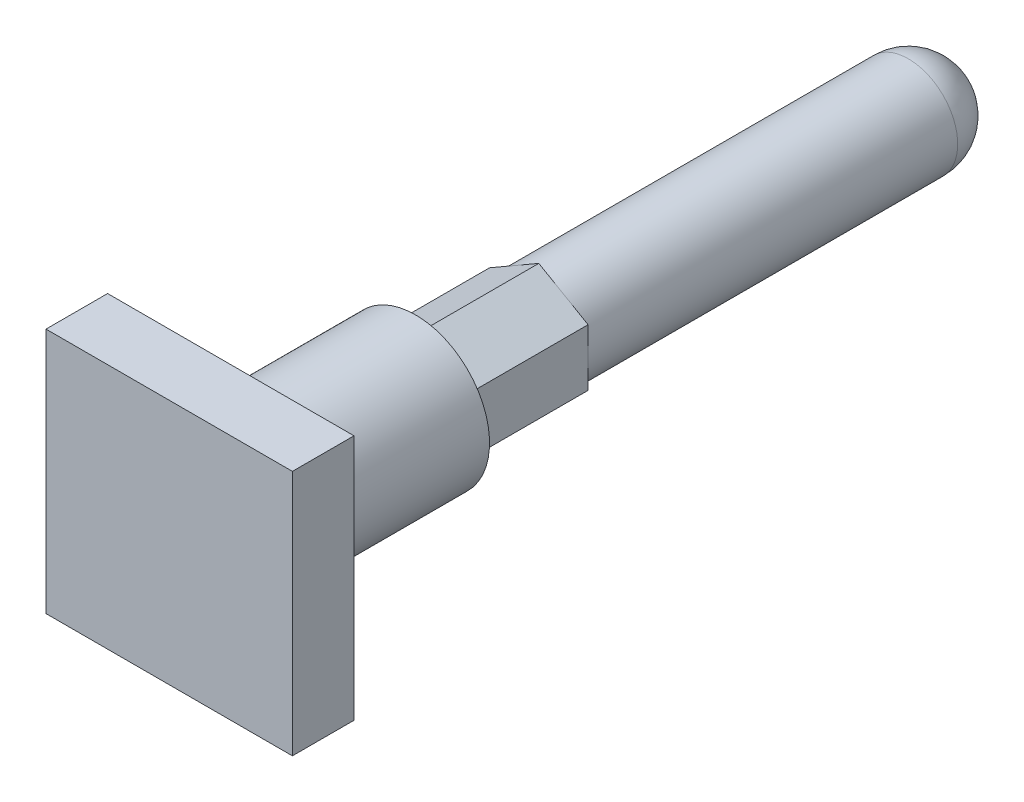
ISO-10303-21;
HEADER;
FILE_DESCRIPTION(('STEP AP214'),'2;1');
FILE_NAME('part.step','',(''),(''),'','','');
FILE_SCHEMA(('AUTOMOTIVE_DESIGN { 1 0 10303 214 1 1 1 1 }'));
ENDSEC;
DATA;
#1=APPLICATION_CONTEXT('core data for automotive mechanical design processes');
#2=APPLICATION_PROTOCOL_DEFINITION('international standard','automotive_design',2000,#1);
#3=PRODUCT_CONTEXT('',#1,'mechanical');
#4=PRODUCT('Part','Part','',(#3));
#5=PRODUCT_RELATED_PRODUCT_CATEGORY('part','',(#4));
#6=PRODUCT_DEFINITION_FORMATION('','',#4);
#7=PRODUCT_DEFINITION_CONTEXT('part definition',#1,'design');
#8=PRODUCT_DEFINITION('design','',#6,#7);
#9=PRODUCT_DEFINITION_SHAPE('','',#8);
#10=(LENGTH_UNIT() NAMED_UNIT(*) SI_UNIT(.MILLI.,.METRE.));
#11=(NAMED_UNIT(*) PLANE_ANGLE_UNIT() SI_UNIT($,.RADIAN.));
#12=(NAMED_UNIT(*) SI_UNIT($,.STERADIAN.) SOLID_ANGLE_UNIT());
#13=UNCERTAINTY_MEASURE_WITH_UNIT(LENGTH_MEASURE(1.E-05),#10,'distance_accuracy_value','');
#14=(GEOMETRIC_REPRESENTATION_CONTEXT(3) GLOBAL_UNCERTAINTY_ASSIGNED_CONTEXT((#13)) GLOBAL_UNIT_ASSIGNED_CONTEXT((#10,
#11,#12)) REPRESENTATION_CONTEXT('',''));
#15=CARTESIAN_POINT('',(0.,0.,0.));
#16=DIRECTION('',(0.,0.,1.));
#17=DIRECTION('',(1.,0.,0.));
#18=AXIS2_PLACEMENT_3D('',#15,#16,#17);
#19=CARTESIAN_POINT('',(0.,0.,-25.));
#20=DIRECTION('',(0.,0.,-1.));
#21=DIRECTION('',(-1.,0.,0.));
#22=AXIS2_PLACEMENT_3D('',#19,#20,#21);
#23=PLANE('',#22);
#24=CARTESIAN_POINT('',(0.,0.,-25.));
#25=DIRECTION('',(0.,0.,-1.));
#26=DIRECTION('',(-1.,0.,0.));
#27=AXIS2_PLACEMENT_3D('',#24,#25,#26);
#28=CIRCLE('',#27,4.);
#29=CARTESIAN_POINT('',(-4.,0.,-25.));
#30=VERTEX_POINT('',#29);
#31=CARTESIAN_POINT('',(-2.,3.46410161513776,-25.));
#32=VERTEX_POINT('',#31);
#33=EDGE_CURVE('E48',#30,#32,#28,.T.);
#34=ORIENTED_EDGE('',*,*,#33,.F.);
#35=DIRECTION('',(0.,1.,0.));
#36=VECTOR('',#35,1.);
#37=CARTESIAN_POINT('',(-4.,-2.3094010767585,-25.));
#38=LINE('',#37,#36);
#39=CARTESIAN_POINT('',(-4.,2.30940107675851,-25.));
#40=VERTEX_POINT('',#39);
#41=EDGE_CURVE('E142',#30,#40,#38,.T.);
#42=ORIENTED_EDGE('',*,*,#41,.T.);
#43=DIRECTION('',(0.866025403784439,0.5,0.));
#44=VECTOR('',#43,1.);
#45=CARTESIAN_POINT('',(-4.,2.30940107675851,-25.));
#46=LINE('',#45,#44);
#47=EDGE_CURVE('E155',#40,#32,#46,.T.);
#48=ORIENTED_EDGE('',*,*,#47,.T.);
#49=EDGE_LOOP('',(#34,#42,#48));
#50=FACE_BOUND('',#49,.T.);
#51=ADVANCED_FACE('F37',(#50),#23,.T.);
#52=CARTESIAN_POINT('',(2.,3.46410161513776,-25.));
#53=VERTEX_POINT('',#52);
#54=EDGE_CURVE('E11',#32,#53,#28,.T.);
#55=ORIENTED_EDGE('',*,*,#54,.F.);
#56=CARTESIAN_POINT('',(0.,4.61880215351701,-25.));
#57=VERTEX_POINT('',#56);
#58=EDGE_CURVE('E141',#32,#57,#46,.T.);
#59=ORIENTED_EDGE('',*,*,#58,.T.);
#60=DIRECTION('',(0.866025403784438,-0.5,0.));
#61=VECTOR('',#60,1.);
#62=CARTESIAN_POINT('',(0.,4.61880215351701,-25.));
#63=LINE('',#62,#61);
#64=EDGE_CURVE('E168',#57,#53,#63,.T.);
#65=ORIENTED_EDGE('',*,*,#64,.T.);
#66=EDGE_LOOP('',(#55,#59,#65));
#67=FACE_BOUND('',#66,.T.);
#68=ADVANCED_FACE('F274',(#67),#23,.T.);
#69=CARTESIAN_POINT('',(4.,0.,-25.));
#70=VERTEX_POINT('',#69);
#71=EDGE_CURVE('E46',#53,#70,#28,.T.);
#72=ORIENTED_EDGE('',*,*,#71,.F.);
#73=CARTESIAN_POINT('',(4.,2.30940107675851,-25.));
#74=VERTEX_POINT('',#73);
#75=EDGE_CURVE('E167',#53,#74,#63,.T.);
#76=ORIENTED_EDGE('',*,*,#75,.T.);
#77=DIRECTION('',(0.,-1.,0.));
#78=VECTOR('',#77,1.);
#79=CARTESIAN_POINT('',(4.,2.30940107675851,-25.));
#80=LINE('',#79,#78);
#81=EDGE_CURVE('E172',#74,#70,#80,.T.);
#82=ORIENTED_EDGE('',*,*,#81,.T.);
#83=EDGE_LOOP('',(#72,#76,#82));
#84=FACE_BOUND('',#83,.T.);
#85=ADVANCED_FACE('F279',(#84),#23,.T.);
#86=CARTESIAN_POINT('',(2.,-3.46410161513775,-25.));
#87=VERTEX_POINT('',#86);
#88=EDGE_CURVE('E161',#70,#87,#28,.T.);
#89=ORIENTED_EDGE('',*,*,#88,.F.);
#90=CARTESIAN_POINT('',(4.,-2.3094010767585,-25.));
#91=VERTEX_POINT('',#90);
#92=EDGE_CURVE('E171',#70,#91,#80,.T.);
#93=ORIENTED_EDGE('',*,*,#92,.T.);
#94=DIRECTION('',(-0.866025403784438,-0.5,0.));
#95=VECTOR('',#94,1.);
#96=CARTESIAN_POINT('',(4.,-2.3094010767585,-25.));
#97=LINE('',#96,#95);
#98=EDGE_CURVE('E176',#91,#87,#97,.T.);
#99=ORIENTED_EDGE('',*,*,#98,.T.);
#100=EDGE_LOOP('',(#89,#93,#99));
#101=FACE_BOUND('',#100,.T.);
#102=ADVANCED_FACE('F295',(#101),#23,.T.);
#103=CARTESIAN_POINT('',(-2.,-3.46410161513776,-25.));
#104=VERTEX_POINT('',#103);
#105=EDGE_CURVE('E63',#87,#104,#28,.T.);
#106=ORIENTED_EDGE('',*,*,#105,.F.);
#107=CARTESIAN_POINT('',(0.,-4.618802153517,-25.));
#108=VERTEX_POINT('',#107);
#109=EDGE_CURVE('E175',#87,#108,#97,.T.);
#110=ORIENTED_EDGE('',*,*,#109,.T.);
#111=DIRECTION('',(-0.866025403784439,0.5,0.));
#112=VECTOR('',#111,1.);
#113=CARTESIAN_POINT('',(0.,-4.618802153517,-25.));
#114=LINE('',#113,#112);
#115=EDGE_CURVE('E179',#108,#104,#114,.T.);
#116=ORIENTED_EDGE('',*,*,#115,.T.);
#117=EDGE_LOOP('',(#106,#110,#116));
#118=FACE_BOUND('',#117,.T.);
#119=ADVANCED_FACE('F285',(#118),#23,.T.);
#120=CARTESIAN_POINT('',(10.,-10.,5.));
#121=DIRECTION('',(-1.,0.,0.));
#122=DIRECTION('',(0.,0.,1.));
#123=AXIS2_PLACEMENT_3D('',#120,#121,#122);
#124=PLANE('',#123);
#125=DIRECTION('',(0.,1.,0.));
#126=VECTOR('',#125,1.);
#127=CARTESIAN_POINT('',(10.,-10.,0.));
#128=LINE('',#127,#126);
#129=CARTESIAN_POINT('',(10.,-10.,0.));
#130=VERTEX_POINT('',#129);
#131=CARTESIAN_POINT('',(10.,10.,0.));
#132=VERTEX_POINT('',#131);
#133=EDGE_CURVE('E214',#130,#132,#128,.T.);
#134=ORIENTED_EDGE('',*,*,#133,.T.);
#135=DIRECTION('',(0.,0.,-1.));
#136=VECTOR('',#135,1.);
#137=CARTESIAN_POINT('',(10.,10.,5.));
#138=LINE('',#137,#136);
#139=CARTESIAN_POINT('',(10.,10.,5.));
#140=VERTEX_POINT('',#139);
#141=EDGE_CURVE('E41',#140,#132,#138,.T.);
#142=ORIENTED_EDGE('',*,*,#141,.F.);
#143=DIRECTION('',(0.,1.,0.));
#144=VECTOR('',#143,1.);
#145=CARTESIAN_POINT('',(10.,-10.,5.));
#146=LINE('',#145,#144);
#147=CARTESIAN_POINT('',(10.,-10.,5.));
#148=VERTEX_POINT('',#147);
#149=EDGE_CURVE('E216',#148,#140,#146,.T.);
#150=ORIENTED_EDGE('',*,*,#149,.F.);
#151=DIRECTION('',(0.,0.,-1.));
#152=VECTOR('',#151,1.);
#153=CARTESIAN_POINT('',(10.,-10.,5.));
#154=LINE('',#153,#152);
#155=EDGE_CURVE('E226',#148,#130,#154,.T.);
#156=ORIENTED_EDGE('',*,*,#155,.T.);
#157=EDGE_LOOP('',(#134,#142,#150,#156));
#158=FACE_BOUND('',#157,.T.);
#159=ADVANCED_FACE('F39',(#158),#124,.F.);
#160=CARTESIAN_POINT('',(-10.,10.,5.));
#161=DIRECTION('',(0.,-1.,0.));
#162=DIRECTION('',(0.,0.,-1.));
#163=AXIS2_PLACEMENT_3D('',#160,#161,#162);
#164=PLANE('',#163);
#165=DIRECTION('',(-1.,0.,0.));
#166=VECTOR('',#165,1.);
#167=CARTESIAN_POINT('',(-10.,10.,0.));
#168=LINE('',#167,#166);
#169=CARTESIAN_POINT('',(-10.,10.,0.));
#170=VERTEX_POINT('',#169);
#171=EDGE_CURVE('E229',#132,#170,#168,.T.);
#172=ORIENTED_EDGE('',*,*,#171,.T.);
#173=DIRECTION('',(0.,0.,-1.));
#174=VECTOR('',#173,1.);
#175=CARTESIAN_POINT('',(-10.,10.,5.));
#176=LINE('',#175,#174);
#177=CARTESIAN_POINT('',(-10.,10.,5.));
#178=VERTEX_POINT('',#177);
#179=EDGE_CURVE('E238',#178,#170,#176,.T.);
#180=ORIENTED_EDGE('',*,*,#179,.F.);
#181=DIRECTION('',(-1.,0.,0.));
#182=VECTOR('',#181,1.);
#183=CARTESIAN_POINT('',(-10.,10.,5.));
#184=LINE('',#183,#182);
#185=EDGE_CURVE('E219',#140,#178,#184,.T.);
#186=ORIENTED_EDGE('',*,*,#185,.F.);
#187=ORIENTED_EDGE('',*,*,#141,.T.);
#188=EDGE_LOOP('',(#172,#180,#186,#187));
#189=FACE_BOUND('',#188,.T.);
#190=ADVANCED_FACE('F247',(#189),#164,.F.);
#191=CARTESIAN_POINT('',(-10.,-10.,5.));
#192=DIRECTION('',(1.,0.,0.));
#193=DIRECTION('',(0.,0.,-1.));
#194=AXIS2_PLACEMENT_3D('',#191,#192,#193);
#195=PLANE('',#194);
#196=DIRECTION('',(0.,-1.,0.));
#197=VECTOR('',#196,1.);
#198=CARTESIAN_POINT('',(-10.,-10.,0.));
#199=LINE('',#198,#197);
#200=CARTESIAN_POINT('',(-10.,-10.,0.));
#201=VERTEX_POINT('',#200);
#202=EDGE_CURVE('E231',#170,#201,#199,.T.);
#203=ORIENTED_EDGE('',*,*,#202,.T.);
#204=DIRECTION('',(0.,0.,-1.));
#205=VECTOR('',#204,1.);
#206=CARTESIAN_POINT('',(-10.,-10.,5.));
#207=LINE('',#206,#205);
#208=CARTESIAN_POINT('',(-10.,-10.,5.));
#209=VERTEX_POINT('',#208);
#210=EDGE_CURVE('E236',#209,#201,#207,.T.);
#211=ORIENTED_EDGE('',*,*,#210,.F.);
#212=DIRECTION('',(0.,-1.,0.));
#213=VECTOR('',#212,1.);
#214=CARTESIAN_POINT('',(-10.,-10.,5.));
#215=LINE('',#214,#213);
#216=EDGE_CURVE('E222',#178,#209,#215,.T.);
#217=ORIENTED_EDGE('',*,*,#216,.F.);
#218=ORIENTED_EDGE('',*,*,#179,.T.);
#219=EDGE_LOOP('',(#203,#211,#217,#218));
#220=FACE_BOUND('',#219,.T.);
#221=ADVANCED_FACE('F256',(#220),#195,.F.);
#222=CARTESIAN_POINT('',(-10.,-10.,5.));
#223=DIRECTION('',(0.,1.,0.));
#224=DIRECTION('',(0.,0.,1.));
#225=AXIS2_PLACEMENT_3D('',#222,#223,#224);
#226=PLANE('',#225);
#227=DIRECTION('',(1.,0.,0.));
#228=VECTOR('',#227,1.);
#229=CARTESIAN_POINT('',(-10.,-10.,0.));
#230=LINE('',#229,#228);
#231=EDGE_CURVE('E220',#201,#130,#230,.T.);
#232=ORIENTED_EDGE('',*,*,#231,.T.);
#233=ORIENTED_EDGE('',*,*,#155,.F.);
#234=DIRECTION('',(1.,0.,0.));
#235=VECTOR('',#234,1.);
#236=CARTESIAN_POINT('',(-10.,-10.,5.));
#237=LINE('',#236,#235);
#238=EDGE_CURVE('E224',#209,#148,#237,.T.);
#239=ORIENTED_EDGE('',*,*,#238,.F.);
#240=ORIENTED_EDGE('',*,*,#210,.T.);
#241=EDGE_LOOP('',(#232,#233,#239,#240));
#242=FACE_BOUND('',#241,.T.);
#243=ADVANCED_FACE('F259',(#242),#226,.F.);
#244=CARTESIAN_POINT('',(0.,0.,5.));
#245=DIRECTION('',(0.,0.,-1.));
#246=DIRECTION('',(-1.,0.,0.));
#247=AXIS2_PLACEMENT_3D('',#244,#245,#246);
#248=PLANE('',#247);
#249=ORIENTED_EDGE('',*,*,#149,.T.);
#250=ORIENTED_EDGE('',*,*,#185,.T.);
#251=ORIENTED_EDGE('',*,*,#216,.T.);
#252=ORIENTED_EDGE('',*,*,#238,.T.);
#253=EDGE_LOOP('',(#249,#250,#251,#252));
#254=FACE_BOUND('',#253,.T.);
#255=ADVANCED_FACE('F261',(#254),#248,.F.);
#256=CARTESIAN_POINT('',(0.,0.,0.));
#257=DIRECTION('',(0.,0.,-1.));
#258=DIRECTION('',(-1.,0.,0.));
#259=AXIS2_PLACEMENT_3D('',#256,#257,#258);
#260=PLANE('',#259);
#261=CARTESIAN_POINT('',(0.,0.,0.));
#262=DIRECTION('',(0.,0.,-1.));
#263=DIRECTION('',(-1.,0.,0.));
#264=AXIS2_PLACEMENT_3D('',#261,#262,#263);
#265=CIRCLE('',#264,6.);
#266=CARTESIAN_POINT('',(-6.,0.,0.));
#267=VERTEX_POINT('',#266);
#268=EDGE_CURVE('E160',#267,#267,#265,.T.);
#269=ORIENTED_EDGE('',*,*,#268,.F.);
#270=EDGE_LOOP('',(#269));
#271=FACE_BOUND('',#270,.T.);
#272=ORIENTED_EDGE('',*,*,#133,.F.);
#273=ORIENTED_EDGE('',*,*,#231,.F.);
#274=ORIENTED_EDGE('',*,*,#202,.F.);
#275=ORIENTED_EDGE('',*,*,#171,.F.);
#276=EDGE_LOOP('',(#272,#273,#274,#275));
#277=FACE_BOUND('',#276,.T.);
#278=ADVANCED_FACE('F254',(#271,#277),#260,.T.);
#279=CARTESIAN_POINT('',(0.,0.,-15.));
#280=DIRECTION('',(0.,0.,1.));
#281=DIRECTION('',(1.,0.,0.));
#282=AXIS2_PLACEMENT_3D('',#279,#280,#281);
#283=CYLINDRICAL_SURFACE('',#282,6.);
#284=CARTESIAN_POINT('',(0.,0.,-15.));
#285=DIRECTION('',(0.,0.,-1.));
#286=DIRECTION('',(-1.,0.,0.));
#287=AXIS2_PLACEMENT_3D('',#284,#285,#286);
#288=CIRCLE('',#287,6.);
#289=CARTESIAN_POINT('',(-6.,0.,-15.));
#290=VERTEX_POINT('',#289);
#291=EDGE_CURVE('E212',#290,#290,#288,.T.);
#292=ORIENTED_EDGE('',*,*,#291,.F.);
#293=EDGE_LOOP('',(#292));
#294=FACE_BOUND('',#293,.T.);
#295=ORIENTED_EDGE('',*,*,#268,.T.);
#296=EDGE_LOOP('',(#295));
#297=FACE_BOUND('',#296,.T.);
#298=ADVANCED_FACE('F268',(#294,#297),#283,.T.);
#299=CARTESIAN_POINT('',(0.,0.,-15.));
#300=DIRECTION('',(0.,0.,-1.));
#301=DIRECTION('',(-1.,0.,0.));
#302=AXIS2_PLACEMENT_3D('',#299,#300,#301);
#303=PLANE('',#302);
#304=DIRECTION('',(0.,1.,0.));
#305=VECTOR('',#304,1.);
#306=CARTESIAN_POINT('',(-4.,-2.3094010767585,-15.));
#307=LINE('',#306,#305);
#308=CARTESIAN_POINT('',(-4.,-2.3094010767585,-15.));
#309=VERTEX_POINT('',#308);
#310=CARTESIAN_POINT('',(-4.,2.30940107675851,-15.));
#311=VERTEX_POINT('',#310);
#312=EDGE_CURVE('E182',#309,#311,#307,.T.);
#313=ORIENTED_EDGE('',*,*,#312,.F.);
#314=DIRECTION('',(-0.866025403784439,0.5,0.));
#315=VECTOR('',#314,1.);
#316=CARTESIAN_POINT('',(0.,-4.618802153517,-15.));
#317=LINE('',#316,#315);
#318=CARTESIAN_POINT('',(0.,-4.618802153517,-15.));
#319=VERTEX_POINT('',#318);
#320=EDGE_CURVE('E153',#319,#309,#317,.T.);
#321=ORIENTED_EDGE('',*,*,#320,.F.);
#322=DIRECTION('',(-0.866025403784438,-0.5,0.));
#323=VECTOR('',#322,1.);
#324=CARTESIAN_POINT('',(4.,-2.3094010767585,-15.));
#325=LINE('',#324,#323);
#326=CARTESIAN_POINT('',(4.,-2.3094010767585,-15.));
#327=VERTEX_POINT('',#326);
#328=EDGE_CURVE('E193',#327,#319,#325,.T.);
#329=ORIENTED_EDGE('',*,*,#328,.F.);
#330=DIRECTION('',(0.,-1.,0.));
#331=VECTOR('',#330,1.);
#332=CARTESIAN_POINT('',(4.,2.30940107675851,-15.));
#333=LINE('',#332,#331);
#334=CARTESIAN_POINT('',(4.,2.30940107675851,-15.));
#335=VERTEX_POINT('',#334);
#336=EDGE_CURVE('E190',#335,#327,#333,.T.);
#337=ORIENTED_EDGE('',*,*,#336,.F.);
#338=DIRECTION('',(0.866025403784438,-0.5,0.));
#339=VECTOR('',#338,1.);
#340=CARTESIAN_POINT('',(0.,4.61880215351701,-15.));
#341=LINE('',#340,#339);
#342=CARTESIAN_POINT('',(0.,4.61880215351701,-15.));
#343=VERTEX_POINT('',#342);
#344=EDGE_CURVE('E187',#343,#335,#341,.T.);
#345=ORIENTED_EDGE('',*,*,#344,.F.);
#346=DIRECTION('',(0.866025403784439,0.5,0.));
#347=VECTOR('',#346,1.);
#348=CARTESIAN_POINT('',(-4.,2.30940107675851,-15.));
#349=LINE('',#348,#347);
#350=EDGE_CURVE('E184',#311,#343,#349,.T.);
#351=ORIENTED_EDGE('',*,*,#350,.F.);
#352=EDGE_LOOP('',(#313,#321,#329,#337,#345,#351));
#353=FACE_BOUND('',#352,.T.);
#354=ORIENTED_EDGE('',*,*,#291,.T.);
#355=EDGE_LOOP('',(#354));
#356=FACE_BOUND('',#355,.T.);
#357=ADVANCED_FACE('F325',(#353,#356),#303,.T.);
#358=CARTESIAN_POINT('',(-4.,-2.3094010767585,-25.));
#359=DIRECTION('',(1.,0.,0.));
#360=DIRECTION('',(0.,1.,0.));
#361=AXIS2_PLACEMENT_3D('',#358,#359,#360);
#362=PLANE('',#361);
#363=ORIENTED_EDGE('',*,*,#312,.T.);
#364=DIRECTION('',(0.,0.,1.));
#365=VECTOR('',#364,1.);
#366=CARTESIAN_POINT('',(-4.,2.30940107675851,-25.));
#367=LINE('',#366,#365);
#368=EDGE_CURVE('E149',#40,#311,#367,.T.);
#369=ORIENTED_EDGE('',*,*,#368,.F.);
#370=ORIENTED_EDGE('',*,*,#41,.F.);
#371=CARTESIAN_POINT('',(-4.,-2.3094010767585,-25.));
#372=VERTEX_POINT('',#371);
#373=EDGE_CURVE('E134',#372,#30,#38,.T.);
#374=ORIENTED_EDGE('',*,*,#373,.F.);
#375=DIRECTION('',(0.,0.,1.));
#376=VECTOR('',#375,1.);
#377=CARTESIAN_POINT('',(-4.,-2.3094010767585,-25.));
#378=LINE('',#377,#376);
#379=EDGE_CURVE('E181',#372,#309,#378,.T.);
#380=ORIENTED_EDGE('',*,*,#379,.T.);
#381=EDGE_LOOP('',(#363,#369,#370,#374,#380));
#382=FACE_BOUND('',#381,.T.);
#383=ADVANCED_FACE('F147',(#382),#362,.F.);
#384=CARTESIAN_POINT('',(-4.,2.30940107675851,-25.));
#385=DIRECTION('',(0.5,-0.866025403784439,0.));
#386=DIRECTION('',(0.866025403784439,0.5,0.));
#387=AXIS2_PLACEMENT_3D('',#384,#385,#386);
#388=PLANE('',#387);
#389=ORIENTED_EDGE('',*,*,#350,.T.);
#390=DIRECTION('',(0.,0.,1.));
#391=VECTOR('',#390,1.);
#392=CARTESIAN_POINT('',(0.,4.61880215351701,-25.));
#393=LINE('',#392,#391);
#394=EDGE_CURVE('E208',#57,#343,#393,.T.);
#395=ORIENTED_EDGE('',*,*,#394,.F.);
#396=ORIENTED_EDGE('',*,*,#58,.F.);
#397=ORIENTED_EDGE('',*,*,#47,.F.);
#398=ORIENTED_EDGE('',*,*,#368,.T.);
#399=EDGE_LOOP('',(#389,#395,#396,#397,#398));
#400=FACE_BOUND('',#399,.T.);
#401=ADVANCED_FACE('F318',(#400),#388,.F.);
#402=CARTESIAN_POINT('',(0.,4.61880215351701,-25.));
#403=DIRECTION('',(-0.5,-0.866025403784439,0.));
#404=DIRECTION('',(0.866025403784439,-0.5,0.));
#405=AXIS2_PLACEMENT_3D('',#402,#403,#404);
#406=PLANE('',#405);
#407=ORIENTED_EDGE('',*,*,#344,.T.);
#408=DIRECTION('',(0.,0.,1.));
#409=VECTOR('',#408,1.);
#410=CARTESIAN_POINT('',(4.,2.30940107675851,-25.));
#411=LINE('',#410,#409);
#412=EDGE_CURVE('E205',#74,#335,#411,.T.);
#413=ORIENTED_EDGE('',*,*,#412,.F.);
#414=ORIENTED_EDGE('',*,*,#75,.F.);
#415=ORIENTED_EDGE('',*,*,#64,.F.);
#416=ORIENTED_EDGE('',*,*,#394,.T.);
#417=EDGE_LOOP('',(#407,#413,#414,#415,#416));
#418=FACE_BOUND('',#417,.T.);
#419=ADVANCED_FACE('F320',(#418),#406,.F.);
#420=CARTESIAN_POINT('',(4.,2.30940107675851,-25.));
#421=DIRECTION('',(-1.,0.,0.));
#422=DIRECTION('',(0.,-1.,0.));
#423=AXIS2_PLACEMENT_3D('',#420,#421,#422);
#424=PLANE('',#423);
#425=ORIENTED_EDGE('',*,*,#336,.T.);
#426=DIRECTION('',(0.,0.,1.));
#427=VECTOR('',#426,1.);
#428=CARTESIAN_POINT('',(4.,-2.3094010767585,-25.));
#429=LINE('',#428,#427);
#430=EDGE_CURVE('E202',#91,#327,#429,.T.);
#431=ORIENTED_EDGE('',*,*,#430,.F.);
#432=ORIENTED_EDGE('',*,*,#92,.F.);
#433=ORIENTED_EDGE('',*,*,#81,.F.);
#434=ORIENTED_EDGE('',*,*,#412,.T.);
#435=EDGE_LOOP('',(#425,#431,#432,#433,#434));
#436=FACE_BOUND('',#435,.T.);
#437=ADVANCED_FACE('F311',(#436),#424,.F.);
#438=CARTESIAN_POINT('',(4.,-2.3094010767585,-25.));
#439=DIRECTION('',(-0.5,0.866025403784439,0.));
#440=DIRECTION('',(-0.866025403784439,-0.5,0.));
#441=AXIS2_PLACEMENT_3D('',#438,#439,#440);
#442=PLANE('',#441);
#443=ORIENTED_EDGE('',*,*,#328,.T.);
#444=DIRECTION('',(0.,0.,1.));
#445=VECTOR('',#444,1.);
#446=CARTESIAN_POINT('',(0.,-4.618802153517,-25.));
#447=LINE('',#446,#445);
#448=EDGE_CURVE('E199',#108,#319,#447,.T.);
#449=ORIENTED_EDGE('',*,*,#448,.F.);
#450=ORIENTED_EDGE('',*,*,#109,.F.);
#451=ORIENTED_EDGE('',*,*,#98,.F.);
#452=ORIENTED_EDGE('',*,*,#430,.T.);
#453=EDGE_LOOP('',(#443,#449,#450,#451,#452));
#454=FACE_BOUND('',#453,.T.);
#455=ADVANCED_FACE('F292',(#454),#442,.F.);
#456=CARTESIAN_POINT('',(0.,-4.618802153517,-25.));
#457=DIRECTION('',(0.5,0.866025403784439,0.));
#458=DIRECTION('',(-0.866025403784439,0.5,0.));
#459=AXIS2_PLACEMENT_3D('',#456,#457,#458);
#460=PLANE('',#459);
#461=ORIENTED_EDGE('',*,*,#320,.T.);
#462=ORIENTED_EDGE('',*,*,#379,.F.);
#463=EDGE_CURVE('E137',#104,#372,#114,.T.);
#464=ORIENTED_EDGE('',*,*,#463,.F.);
#465=ORIENTED_EDGE('',*,*,#115,.F.);
#466=ORIENTED_EDGE('',*,*,#448,.T.);
#467=EDGE_LOOP('',(#461,#462,#464,#465,#466));
#468=FACE_BOUND('',#467,.T.);
#469=ADVANCED_FACE('F284',(#468),#460,.F.);
#470=EDGE_CURVE('E55',#104,#30,#28,.T.);
#471=ORIENTED_EDGE('',*,*,#470,.F.);
#472=ORIENTED_EDGE('',*,*,#463,.T.);
#473=ORIENTED_EDGE('',*,*,#373,.T.);
#474=EDGE_LOOP('',(#471,#472,#473));
#475=FACE_BOUND('',#474,.T.);
#476=ADVANCED_FACE('F136',(#475),#23,.T.);
#477=CARTESIAN_POINT('',(0.,0.,-55.));
#478=DIRECTION('',(0.,0.,1.));
#479=DIRECTION('',(1.,0.,0.));
#480=AXIS2_PLACEMENT_3D('',#477,#478,#479);
#481=CYLINDRICAL_SURFACE('',#480,4.);
#482=CARTESIAN_POINT('',(0.,0.,-55.));
#483=DIRECTION('',(0.,0.,-1.));
#484=DIRECTION('',(-1.,0.,0.));
#485=AXIS2_PLACEMENT_3D('',#482,#483,#484);
#486=CIRCLE('',#485,4.);
#487=CARTESIAN_POINT('',(-4.,0.,-55.));
#488=VERTEX_POINT('',#487);
#489=EDGE_CURVE('E157',#488,#488,#486,.T.);
#490=ORIENTED_EDGE('',*,*,#489,.F.);
#491=EDGE_LOOP('',(#490));
#492=FACE_BOUND('',#491,.T.);
#493=ORIENTED_EDGE('',*,*,#33,.T.);
#494=ORIENTED_EDGE('',*,*,#54,.T.);
#495=ORIENTED_EDGE('',*,*,#71,.T.);
#496=ORIENTED_EDGE('',*,*,#88,.T.);
#497=ORIENTED_EDGE('',*,*,#105,.T.);
#498=ORIENTED_EDGE('',*,*,#470,.T.);
#499=EDGE_LOOP('',(#493,#494,#495,#496,#497,#498));
#500=FACE_BOUND('',#499,.T.);
#501=ADVANCED_FACE('F158',(#492,#500),#481,.T.);
#502=CARTESIAN_POINT('',(0.,0.,-55.));
#503=DIRECTION('',(1.,0.,0.));
#504=DIRECTION('',(0.,0.,1.));
#505=AXIS2_PLACEMENT_3D('',#502,#503,#504);
#506=SPHERICAL_SURFACE('',#505,4.);
#507=CARTESIAN_POINT('',(0.,0.,-55.));
#508=DIRECTION('',(0.,0.,-1.));
#509=DIRECTION('',(-1.,0.,0.));
#510=AXIS2_PLACEMENT_3D('',#507,#508,#509);
#511=SPHERICAL_SURFACE('',#510,4.);
#512=ORIENTED_EDGE('',*,*,#489,.T.);
#513=EDGE_LOOP('',(#512));
#514=FACE_BOUND('',#513,.T.);
#515=ADVANCED_FACE('F290',(#514),#511,.T.);
#516=CLOSED_SHELL('',(#51,#68,#85,#102,#119,#159,#190,#221,#243,#255,#278,#298,#357,#383,#401,
#419,#437,#455,#469,#476,#501,#515));
#517=MANIFOLD_SOLID_BREP('B2',#516);
#518=ADVANCED_BREP_SHAPE_REPRESENTATION('',(#18,#517),#14);
#519=SHAPE_DEFINITION_REPRESENTATION(#9,#518);
ENDSEC;
END-ISO-10303-21;
